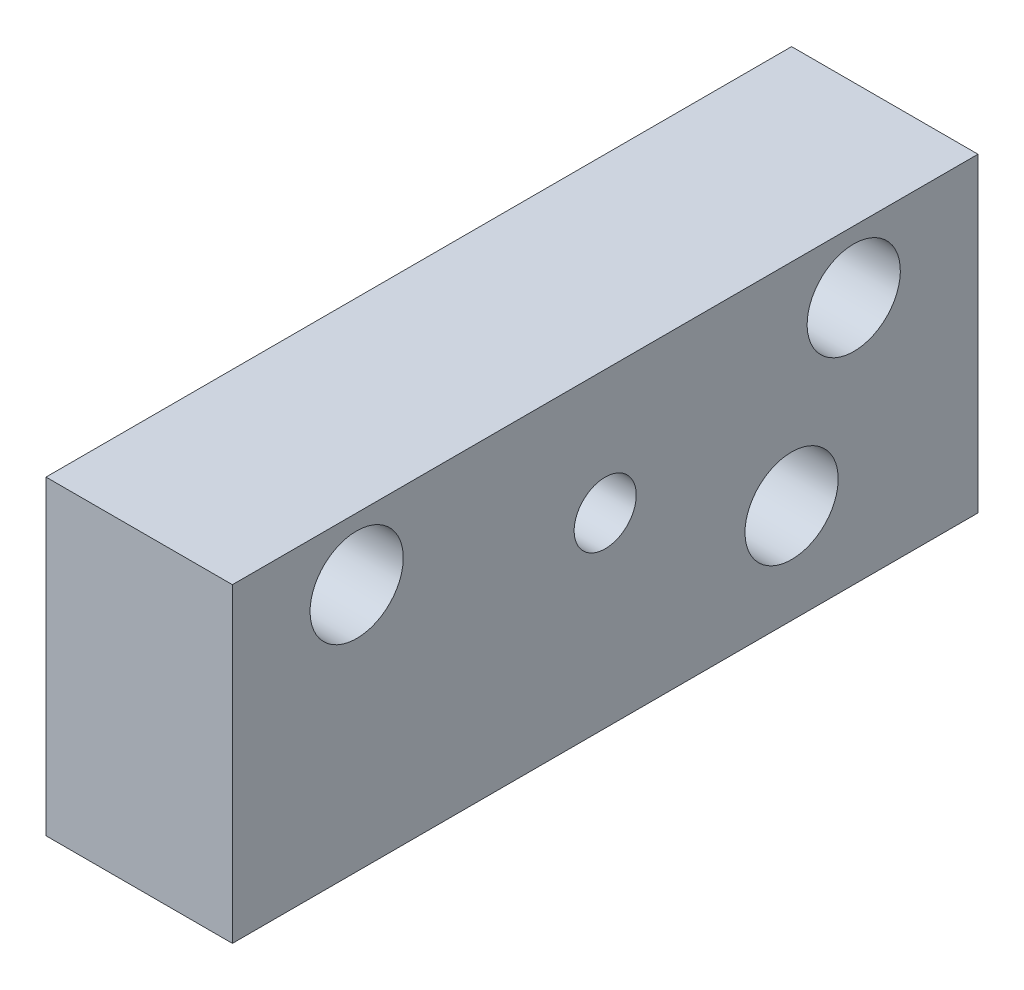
from build123d import *

# Parameters (mm, degrees)
BOSS_EXTRUDE1_DEPTH = 76.2
CUT_EXTRUDE1_REACH  = 86.72
SKETCH2_R           = 3.175
SKETCH2_R_2         = 4.7625


with BuildPart() as part:
    # Sketch1 → Boss-Extrude1 (new body)
    with BuildSketch(Plane.XY):
        Polygon((28.575, 3.175), (28.575, 31.75), (47.625, 31.75), (47.625, 0), (28.575, 0), align=None)
    extrude(amount=BOSS_EXTRUDE1_DEPTH)

    # Sketch2 → Cut-Extrude1 (cut, up to next)
    with BuildSketch(Plane(origin=(47.625, 0, 0), x_dir=(0, 0, -1), z_dir=(1, 0, 0)), mode=Mode.PRIVATE) as cut_extrude1_sk1:
        with Locations(Location((-38.1, 19.05, 0), (0, 0, 90))):
            Circle(SKETCH2_R)
    cut_extrude1_tool1 = extrude(cut_extrude1_sk1.sketch, amount=-CUT_EXTRUDE1_REACH, mode=Mode.PRIVATE) & part.part
    # Sketch2 → Cut-Extrude1 (cut, up to next)
    with BuildSketch(Plane(origin=(47.625, 0, 0), x_dir=(0, 0, -1), z_dir=(1, 0, 0)), mode=Mode.PRIVATE) as cut_extrude1_sk2:
        with Locations(Location((-63.5, 25.4, 0), (0, 0, 90))):
            Circle(SKETCH2_R_2)
    cut_extrude1_tool2 = extrude(cut_extrude1_sk2.sketch, amount=-CUT_EXTRUDE1_REACH, mode=Mode.PRIVATE) & part.part
    # Sketch2 → Cut-Extrude1 (cut, up to next)
    with BuildSketch(Plane(origin=(47.625, 0, 0), x_dir=(0, 0, -1), z_dir=(1, 0, 0)), mode=Mode.PRIVATE) as cut_extrude1_sk3:
        with Locations(Location((-12.7, 25.4, 0), (0, 0, 90))):
            Circle(SKETCH2_R_2)
    cut_extrude1_tool3 = extrude(cut_extrude1_sk3.sketch, amount=-CUT_EXTRUDE1_REACH, mode=Mode.PRIVATE) & part.part
    # Sketch2 → Cut-Extrude1 (cut, up to next)
    with BuildSketch(Plane(origin=(47.625, 0, 0), x_dir=(0, 0, -1), z_dir=(1, 0, 0)), mode=Mode.PRIVATE) as cut_extrude1_sk4:
        with Locations(Location((-19.05, 10.16, 0), (0, 0, 90))):
            Circle(SKETCH2_R_2)
    cut_extrude1_tool4 = extrude(cut_extrude1_sk4.sketch, amount=-CUT_EXTRUDE1_REACH, mode=Mode.PRIVATE) & part.part
    add(cut_extrude1_tool1.solids().sort_by_distance((47.625, 19.05, 38.1))[0], mode=Mode.SUBTRACT)
    add(cut_extrude1_tool2.solids().sort_by_distance((47.625, 25.4, 63.5))[0], mode=Mode.SUBTRACT)
    add(cut_extrude1_tool3.solids().sort_by_distance((47.625, 25.4, 12.7))[0], mode=Mode.SUBTRACT)
    add(cut_extrude1_tool4.solids().sort_by_distance((47.625, 10.16, 19.05))[0], mode=Mode.SUBTRACT)


solid = part.part
